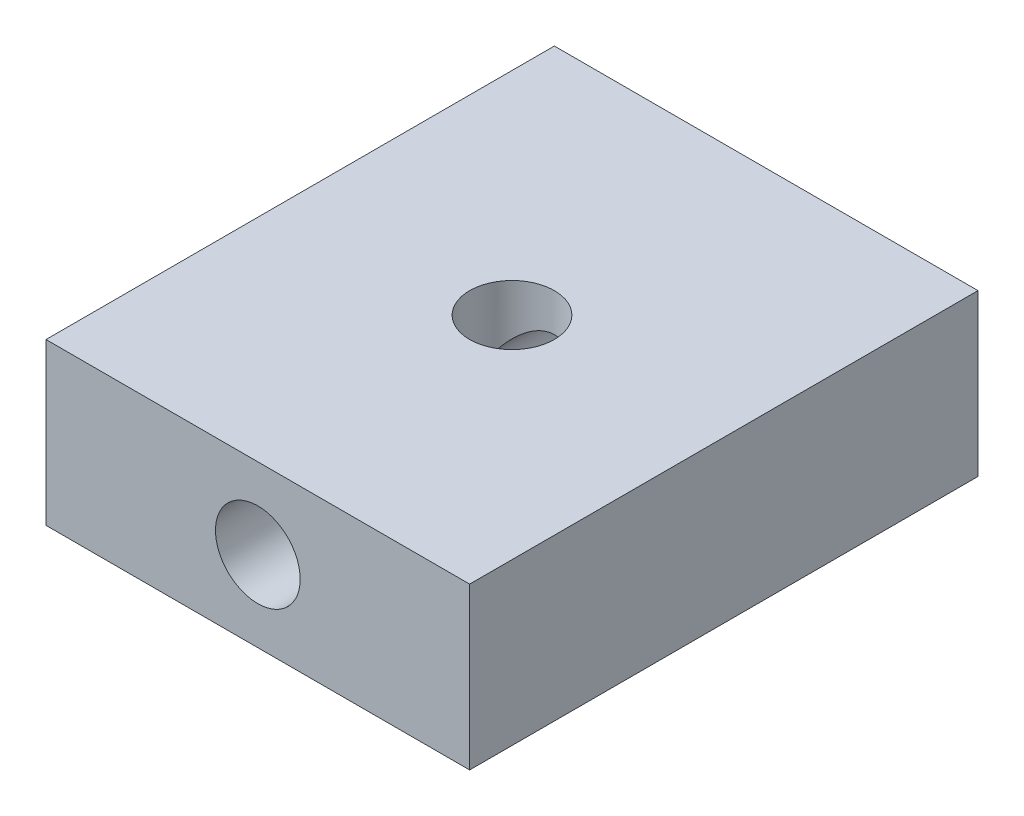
ISO-10303-21;
HEADER;
FILE_DESCRIPTION(('STEP AP214'),'2;1');
FILE_NAME('part.step','',(''),(''),'','','');
FILE_SCHEMA(('AUTOMOTIVE_DESIGN { 1 0 10303 214 1 1 1 1 }'));
ENDSEC;
DATA;
#1=APPLICATION_CONTEXT('core data for automotive mechanical design processes');
#2=APPLICATION_PROTOCOL_DEFINITION('international standard','automotive_design',2000,#1);
#3=PRODUCT_CONTEXT('',#1,'mechanical');
#4=PRODUCT('Part','Part','',(#3));
#5=PRODUCT_RELATED_PRODUCT_CATEGORY('part','',(#4));
#6=PRODUCT_DEFINITION_FORMATION('','',#4);
#7=PRODUCT_DEFINITION_CONTEXT('part definition',#1,'design');
#8=PRODUCT_DEFINITION('design','',#6,#7);
#9=PRODUCT_DEFINITION_SHAPE('','',#8);
#10=(LENGTH_UNIT() NAMED_UNIT(*) SI_UNIT(.MILLI.,.METRE.));
#11=(NAMED_UNIT(*) PLANE_ANGLE_UNIT() SI_UNIT($,.RADIAN.));
#12=(NAMED_UNIT(*) SI_UNIT($,.STERADIAN.) SOLID_ANGLE_UNIT());
#13=UNCERTAINTY_MEASURE_WITH_UNIT(LENGTH_MEASURE(1.E-05),#10,'distance_accuracy_value','');
#14=(GEOMETRIC_REPRESENTATION_CONTEXT(3) GLOBAL_UNCERTAINTY_ASSIGNED_CONTEXT((#13)) GLOBAL_UNIT_ASSIGNED_CONTEXT((#10,
#11,#12)) REPRESENTATION_CONTEXT('',''));
#15=CARTESIAN_POINT('',(0.,0.,0.));
#16=DIRECTION('',(0.,0.,1.));
#17=DIRECTION('',(1.,0.,0.));
#18=AXIS2_PLACEMENT_3D('',#15,#16,#17);
#19=CARTESIAN_POINT('',(0.,9.5,-30.));
#20=DIRECTION('',(0.,0.,1.));
#21=DIRECTION('',(1.,0.,0.));
#22=AXIS2_PLACEMENT_3D('',#19,#20,#21);
#23=CYLINDRICAL_SURFACE('',#22,5.);
#24=CARTESIAN_POINT('',(0.,9.5,30.));
#25=DIRECTION('',(0.,0.,1.));
#26=DIRECTION('',(1.,0.,0.));
#27=AXIS2_PLACEMENT_3D('',#24,#25,#26);
#28=CIRCLE('',#27,5.);
#29=CARTESIAN_POINT('',(5.,9.5,30.));
#30=VERTEX_POINT('',#29);
#31=EDGE_CURVE('E114',#30,#30,#28,.T.);
#32=ORIENTED_EDGE('',*,*,#31,.T.);
#33=EDGE_LOOP('',(#32));
#34=FACE_BOUND('',#33,.T.);
#35=CARTESIAN_POINT('',(0.,9.5,-30.));
#36=DIRECTION('',(0.,0.,1.));
#37=DIRECTION('',(1.,0.,0.));
#38=AXIS2_PLACEMENT_3D('',#35,#36,#37);
#39=CIRCLE('',#38,5.);
#40=CARTESIAN_POINT('',(5.,9.5,-30.));
#41=VERTEX_POINT('',#40);
#42=EDGE_CURVE('E147',#41,#41,#39,.T.);
#43=ORIENTED_EDGE('',*,*,#42,.F.);
#44=EDGE_LOOP('',(#43));
#45=FACE_BOUND('',#44,.T.);
#46=DIRECTION('',(0.,0.,1.));
#47=VECTOR('',#46,1.);
#48=CARTESIAN_POINT('',(-4.9749371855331,10.,-30.));
#49=LINE('',#48,#47);
#50=CARTESIAN_POINT('',(-4.9749371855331,10.,0.500000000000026));
#51=VERTEX_POINT('',#50);
#52=CARTESIAN_POINT('',(-4.9749371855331,10.,-0.500000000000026));
#53=VERTEX_POINT('',#52);
#54=EDGE_CURVE('E11',#51,#53,#49,.F.);
#55=ORIENTED_EDGE('',*,*,#54,.F.);
#56=CARTESIAN_POINT('',(0.,9.5,0.));
#57=DIRECTION('',(0.,-0.707106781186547,0.707106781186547));
#58=DIRECTION('',(0.,0.707106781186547,0.707106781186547));
#59=AXIS2_PLACEMENT_3D('',#56,#57,#58);
#60=ELLIPSE('',#59,7.07106781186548,5.);
#61=CARTESIAN_POINT('',(4.9749371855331,10.,0.499999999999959));
#62=VERTEX_POINT('',#61);
#63=EDGE_CURVE('E106',#51,#62,#60,.F.);
#64=ORIENTED_EDGE('',*,*,#63,.T.);
#65=DIRECTION('',(0.,0.,1.));
#66=VECTOR('',#65,1.);
#67=CARTESIAN_POINT('',(4.9749371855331,10.,-30.));
#68=LINE('',#67,#66);
#69=CARTESIAN_POINT('',(4.9749371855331,10.,-0.499999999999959));
#70=VERTEX_POINT('',#69);
#71=EDGE_CURVE('E100',#70,#62,#68,.T.);
#72=ORIENTED_EDGE('',*,*,#71,.F.);
#73=CARTESIAN_POINT('',(0.,9.5,0.));
#74=DIRECTION('',(0.,0.707106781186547,0.707106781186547));
#75=DIRECTION('',(0.,-0.707106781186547,0.707106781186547));
#76=AXIS2_PLACEMENT_3D('',#73,#74,#75);
#77=ELLIPSE('',#76,7.07106781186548,5.);
#78=EDGE_CURVE('E48',#70,#53,#77,.T.);
#79=ORIENTED_EDGE('',*,*,#78,.T.);
#80=EDGE_LOOP('',(#55,#64,#72,#79));
#81=FACE_BOUND('',#80,.T.);
#82=ADVANCED_FACE('F39',(#34,#45,#81),#23,.F.);
#83=CARTESIAN_POINT('',(25.,19.,-30.));
#84=DIRECTION('',(-1.,0.,0.));
#85=DIRECTION('',(0.,0.,1.));
#86=AXIS2_PLACEMENT_3D('',#83,#84,#85);
#87=PLANE('',#86);
#88=DIRECTION('',(0.,0.,-1.));
#89=VECTOR('',#88,1.);
#90=CARTESIAN_POINT('',(25.,0.,-30.));
#91=LINE('',#90,#89);
#92=CARTESIAN_POINT('',(25.,0.,30.));
#93=VERTEX_POINT('',#92);
#94=CARTESIAN_POINT('',(25.,0.,-30.));
#95=VERTEX_POINT('',#94);
#96=EDGE_CURVE('E143',#93,#95,#91,.T.);
#97=ORIENTED_EDGE('',*,*,#96,.T.);
#98=DIRECTION('',(0.,-1.,0.));
#99=VECTOR('',#98,1.);
#100=CARTESIAN_POINT('',(25.,19.,-30.));
#101=LINE('',#100,#99);
#102=CARTESIAN_POINT('',(25.,19.,-30.));
#103=VERTEX_POINT('',#102);
#104=EDGE_CURVE('E107',#103,#95,#101,.T.);
#105=ORIENTED_EDGE('',*,*,#104,.F.);
#106=DIRECTION('',(0.,0.,-1.));
#107=VECTOR('',#106,1.);
#108=CARTESIAN_POINT('',(25.,19.,-30.));
#109=LINE('',#108,#107);
#110=CARTESIAN_POINT('',(25.,19.,30.));
#111=VERTEX_POINT('',#110);
#112=EDGE_CURVE('E136',#111,#103,#109,.T.);
#113=ORIENTED_EDGE('',*,*,#112,.F.);
#114=DIRECTION('',(0.,-1.,0.));
#115=VECTOR('',#114,1.);
#116=CARTESIAN_POINT('',(25.,19.,30.));
#117=LINE('',#116,#115);
#118=EDGE_CURVE('E131',#111,#93,#117,.T.);
#119=ORIENTED_EDGE('',*,*,#118,.T.);
#120=EDGE_LOOP('',(#97,#105,#113,#119));
#121=FACE_BOUND('',#120,.T.);
#122=ADVANCED_FACE('F41',(#121),#87,.F.);
#123=CARTESIAN_POINT('',(-25.,19.,-30.));
#124=DIRECTION('',(0.,0.,1.));
#125=DIRECTION('',(1.,0.,0.));
#126=AXIS2_PLACEMENT_3D('',#123,#124,#125);
#127=PLANE('',#126);
#128=ORIENTED_EDGE('',*,*,#42,.T.);
#129=EDGE_LOOP('',(#128));
#130=FACE_BOUND('',#129,.T.);
#131=DIRECTION('',(-1.,0.,0.));
#132=VECTOR('',#131,1.);
#133=CARTESIAN_POINT('',(-25.,0.,-30.));
#134=LINE('',#133,#132);
#135=CARTESIAN_POINT('',(-25.,0.,-30.));
#136=VERTEX_POINT('',#135);
#137=EDGE_CURVE('E140',#95,#136,#134,.T.);
#138=ORIENTED_EDGE('',*,*,#137,.T.);
#139=DIRECTION('',(0.,-1.,0.));
#140=VECTOR('',#139,1.);
#141=CARTESIAN_POINT('',(-25.,19.,-30.));
#142=LINE('',#141,#140);
#143=CARTESIAN_POINT('',(-25.,19.,-30.));
#144=VERTEX_POINT('',#143);
#145=EDGE_CURVE('E124',#144,#136,#142,.T.);
#146=ORIENTED_EDGE('',*,*,#145,.F.);
#147=DIRECTION('',(-1.,0.,0.));
#148=VECTOR('',#147,1.);
#149=CARTESIAN_POINT('',(-25.,19.,-30.));
#150=LINE('',#149,#148);
#151=EDGE_CURVE('E92',#103,#144,#150,.T.);
#152=ORIENTED_EDGE('',*,*,#151,.F.);
#153=ORIENTED_EDGE('',*,*,#104,.T.);
#154=EDGE_LOOP('',(#138,#146,#152,#153));
#155=FACE_BOUND('',#154,.T.);
#156=ADVANCED_FACE('F185',(#130,#155),#127,.F.);
#157=CARTESIAN_POINT('',(-25.,19.,-30.));
#158=DIRECTION('',(1.,0.,0.));
#159=DIRECTION('',(0.,0.,-1.));
#160=AXIS2_PLACEMENT_3D('',#157,#158,#159);
#161=PLANE('',#160);
#162=DIRECTION('',(0.,0.,1.));
#163=VECTOR('',#162,1.);
#164=CARTESIAN_POINT('',(-25.,0.,-30.));
#165=LINE('',#164,#163);
#166=CARTESIAN_POINT('',(-25.,0.,30.));
#167=VERTEX_POINT('',#166);
#168=EDGE_CURVE('E137',#136,#167,#165,.T.);
#169=ORIENTED_EDGE('',*,*,#168,.T.);
#170=DIRECTION('',(0.,-1.,0.));
#171=VECTOR('',#170,1.);
#172=CARTESIAN_POINT('',(-25.,19.,30.));
#173=LINE('',#172,#171);
#174=CARTESIAN_POINT('',(-25.,19.,30.));
#175=VERTEX_POINT('',#174);
#176=EDGE_CURVE('E128',#175,#167,#173,.T.);
#177=ORIENTED_EDGE('',*,*,#176,.F.);
#178=DIRECTION('',(0.,0.,1.));
#179=VECTOR('',#178,1.);
#180=CARTESIAN_POINT('',(-25.,19.,-30.));
#181=LINE('',#180,#179);
#182=EDGE_CURVE('E150',#144,#175,#181,.T.);
#183=ORIENTED_EDGE('',*,*,#182,.F.);
#184=ORIENTED_EDGE('',*,*,#145,.T.);
#185=EDGE_LOOP('',(#169,#177,#183,#184));
#186=FACE_BOUND('',#185,.T.);
#187=ADVANCED_FACE('F199',(#186),#161,.F.);
#188=CARTESIAN_POINT('',(-25.,19.,30.));
#189=DIRECTION('',(0.,0.,-1.));
#190=DIRECTION('',(-1.,0.,0.));
#191=AXIS2_PLACEMENT_3D('',#188,#189,#190);
#192=PLANE('',#191);
#193=ORIENTED_EDGE('',*,*,#31,.F.);
#194=EDGE_LOOP('',(#193));
#195=FACE_BOUND('',#194,.T.);
#196=DIRECTION('',(1.,0.,0.));
#197=VECTOR('',#196,1.);
#198=CARTESIAN_POINT('',(-25.,0.,30.));
#199=LINE('',#198,#197);
#200=EDGE_CURVE('E84',#167,#93,#199,.T.);
#201=ORIENTED_EDGE('',*,*,#200,.T.);
#202=ORIENTED_EDGE('',*,*,#118,.F.);
#203=DIRECTION('',(1.,0.,0.));
#204=VECTOR('',#203,1.);
#205=CARTESIAN_POINT('',(-25.,19.,30.));
#206=LINE('',#205,#204);
#207=EDGE_CURVE('E63',#175,#111,#206,.T.);
#208=ORIENTED_EDGE('',*,*,#207,.F.);
#209=ORIENTED_EDGE('',*,*,#176,.T.);
#210=EDGE_LOOP('',(#201,#202,#208,#209));
#211=FACE_BOUND('',#210,.T.);
#212=ADVANCED_FACE('F192',(#195,#211),#192,.F.);
#213=CARTESIAN_POINT('',(0.,19.,0.));
#214=DIRECTION('',(0.,1.,0.));
#215=DIRECTION('',(0.,0.,1.));
#216=AXIS2_PLACEMENT_3D('',#213,#214,#215);
#217=PLANE('',#216);
#218=CARTESIAN_POINT('',(0.,19.,0.));
#219=DIRECTION('',(0.,1.,0.));
#220=DIRECTION('',(0.,0.,1.));
#221=AXIS2_PLACEMENT_3D('',#218,#219,#220);
#222=CIRCLE('',#221,5.);
#223=CARTESIAN_POINT('',(0.,19.,5.));
#224=VERTEX_POINT('',#223);
#225=EDGE_CURVE('E163',#224,#224,#222,.T.);
#226=ORIENTED_EDGE('',*,*,#225,.F.);
#227=EDGE_LOOP('',(#226));
#228=FACE_BOUND('',#227,.T.);
#229=ORIENTED_EDGE('',*,*,#112,.T.);
#230=ORIENTED_EDGE('',*,*,#151,.T.);
#231=ORIENTED_EDGE('',*,*,#182,.T.);
#232=ORIENTED_EDGE('',*,*,#207,.T.);
#233=EDGE_LOOP('',(#229,#230,#231,#232));
#234=FACE_BOUND('',#233,.T.);
#235=ADVANCED_FACE('F189',(#228,#234),#217,.T.);
#236=CARTESIAN_POINT('',(0.,0.,0.));
#237=DIRECTION('',(0.,1.,0.));
#238=DIRECTION('',(0.,0.,1.));
#239=AXIS2_PLACEMENT_3D('',#236,#237,#238);
#240=PLANE('',#239);
#241=ORIENTED_EDGE('',*,*,#96,.F.);
#242=ORIENTED_EDGE('',*,*,#200,.F.);
#243=ORIENTED_EDGE('',*,*,#168,.F.);
#244=ORIENTED_EDGE('',*,*,#137,.F.);
#245=EDGE_LOOP('',(#241,#242,#243,#244));
#246=FACE_BOUND('',#245,.T.);
#247=ADVANCED_FACE('F177',(#246),#240,.F.);
#248=CARTESIAN_POINT('',(0.,10.,0.));
#249=DIRECTION('',(0.,1.,0.));
#250=DIRECTION('',(0.,0.,1.));
#251=AXIS2_PLACEMENT_3D('',#248,#249,#250);
#252=CYLINDRICAL_SURFACE('',#251,5.);
#253=ORIENTED_EDGE('',*,*,#225,.T.);
#254=EDGE_LOOP('',(#253));
#255=FACE_BOUND('',#254,.T.);
#256=CARTESIAN_POINT('',(0.,10.,0.));
#257=DIRECTION('',(0.,1.,0.));
#258=DIRECTION('',(0.,0.,1.));
#259=AXIS2_PLACEMENT_3D('',#256,#257,#258);
#260=CIRCLE('',#259,5.);
#261=EDGE_CURVE('E54',#62,#70,#260,.T.);
#262=ORIENTED_EDGE('',*,*,#261,.F.);
#263=ORIENTED_EDGE('',*,*,#63,.F.);
#264=EDGE_CURVE('E115',#53,#51,#260,.T.);
#265=ORIENTED_EDGE('',*,*,#264,.F.);
#266=ORIENTED_EDGE('',*,*,#78,.F.);
#267=EDGE_LOOP('',(#262,#263,#265,#266));
#268=FACE_BOUND('',#267,.T.);
#269=ADVANCED_FACE('F110',(#255,#268),#252,.F.);
#270=CARTESIAN_POINT('',(0.,10.,0.));
#271=DIRECTION('',(0.,1.,0.));
#272=DIRECTION('',(0.,0.,1.));
#273=AXIS2_PLACEMENT_3D('',#270,#271,#272);
#274=PLANE('',#273);
#275=ORIENTED_EDGE('',*,*,#54,.T.);
#276=ORIENTED_EDGE('',*,*,#264,.T.);
#277=EDGE_LOOP('',(#275,#276));
#278=FACE_BOUND('',#277,.T.);
#279=ADVANCED_FACE('F170',(#278),#274,.T.);
#280=ORIENTED_EDGE('',*,*,#71,.T.);
#281=ORIENTED_EDGE('',*,*,#261,.T.);
#282=EDGE_LOOP('',(#280,#281));
#283=FACE_BOUND('',#282,.T.);
#284=ADVANCED_FACE('F101',(#283),#274,.T.);
#285=CLOSED_SHELL('',(#82,#122,#156,#187,#212,#235,#247,#269,#279,#284));
#286=MANIFOLD_SOLID_BREP('B2',#285);
#287=ADVANCED_BREP_SHAPE_REPRESENTATION('',(#18,#286),#14);
#288=SHAPE_DEFINITION_REPRESENTATION(#9,#287);
ENDSEC;
END-ISO-10303-21;
